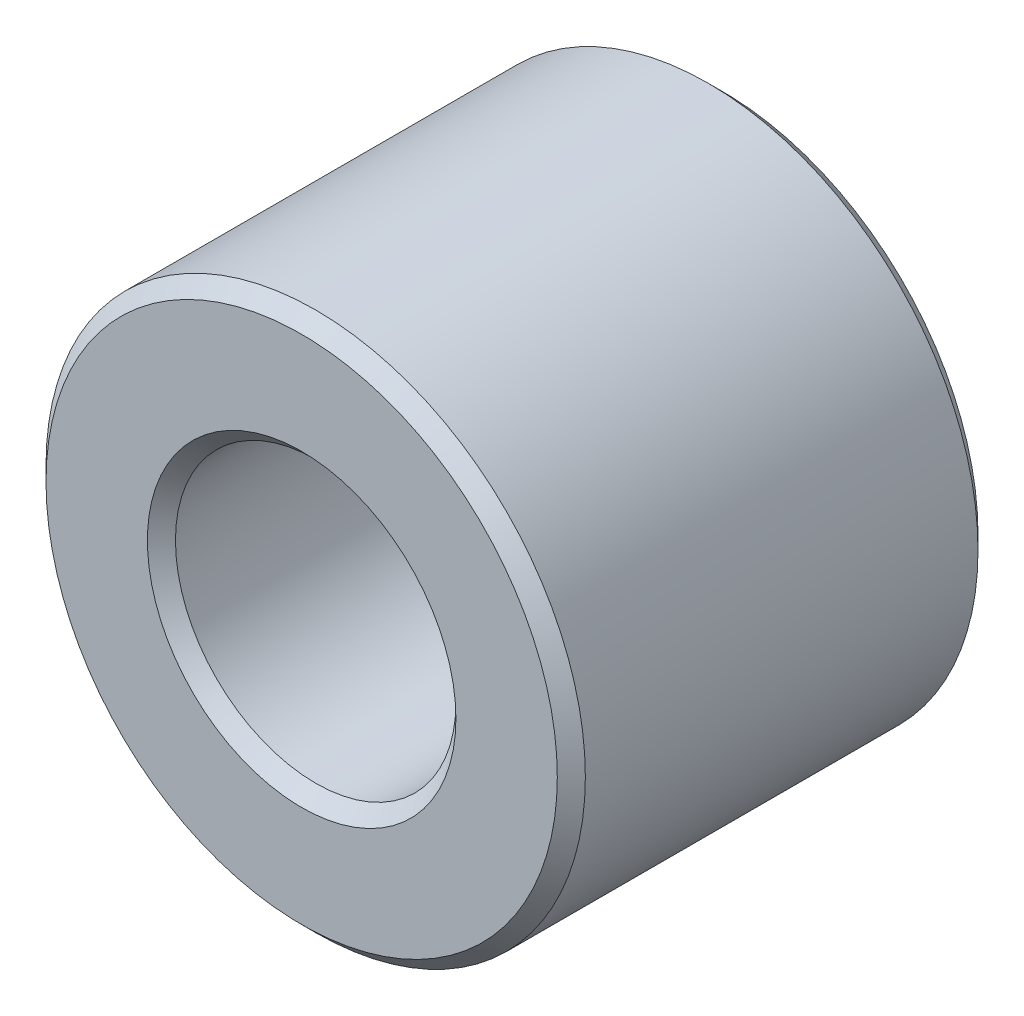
from build123d import *

# Parameters (mm, degrees)
SKETCH1_R           = 25
SKETCH1_R_2         = 13
BOSS_EXTRUDE1_DEPTH = 19.5
CHAMFER1_SIZE       = 1.3


with BuildPart() as part:
    # Sketch1 → Boss-Extrude1 (new, symmetric)
    with BuildSketch(Plane.XY):
        Circle(SKETCH1_R)
        Circle(SKETCH1_R_2, mode=Mode.SUBTRACT)
    extrude(amount=BOSS_EXTRUDE1_DEPTH, both=True)

    # Chamfer1
    chamfer1_edges = [part.edges().sort_by_distance(p)[0] for p in [
        (-25, 0, -19.5),
        (-25, 0, 19.5),
        (-13, 0, -19.5),
        (-13, 0, 19.5),
    ]]
    chamfer(chamfer1_edges, length=CHAMFER1_SIZE)


solid = part.part
